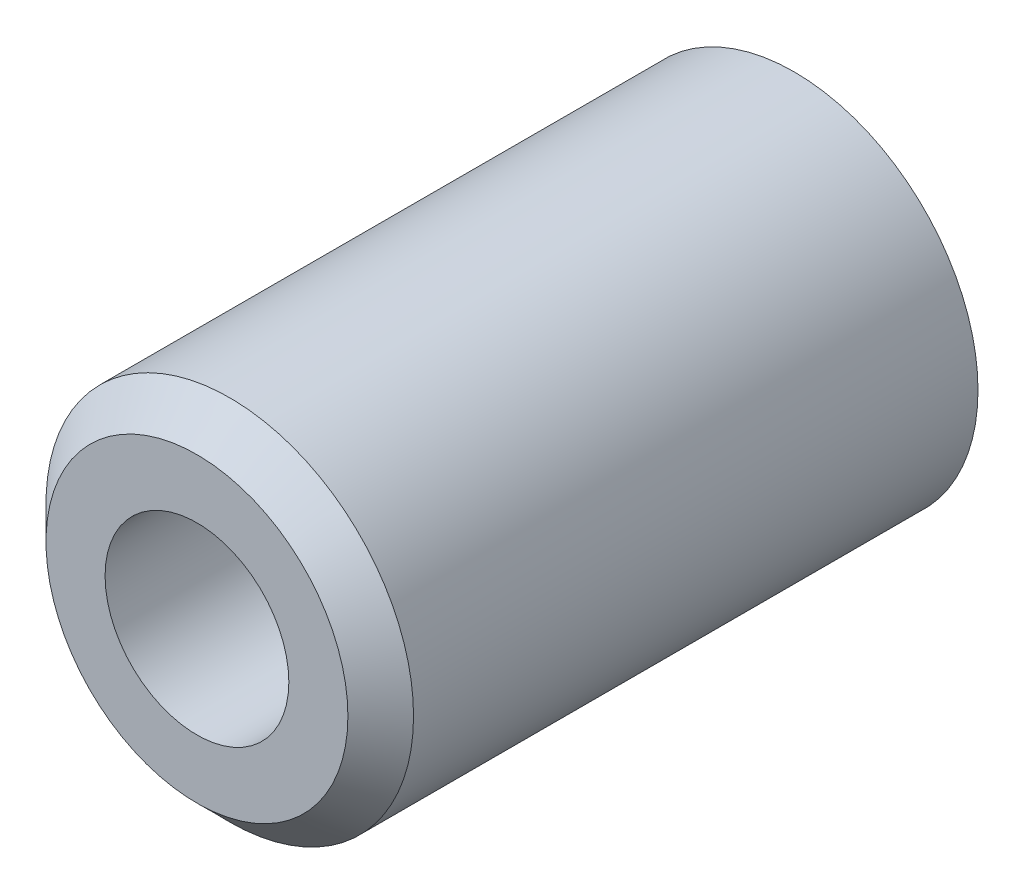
ISO-10303-21;
HEADER;
FILE_DESCRIPTION(('STEP AP214'),'2;1');
FILE_NAME('part.step','',(''),(''),'','','');
FILE_SCHEMA(('AUTOMOTIVE_DESIGN { 1 0 10303 214 1 1 1 1 }'));
ENDSEC;
DATA;
#1=APPLICATION_CONTEXT('core data for automotive mechanical design processes');
#2=APPLICATION_PROTOCOL_DEFINITION('international standard','automotive_design',2000,#1);
#3=PRODUCT_CONTEXT('',#1,'mechanical');
#4=PRODUCT('Part','Part','',(#3));
#5=PRODUCT_RELATED_PRODUCT_CATEGORY('part','',(#4));
#6=PRODUCT_DEFINITION_FORMATION('','',#4);
#7=PRODUCT_DEFINITION_CONTEXT('part definition',#1,'design');
#8=PRODUCT_DEFINITION('design','',#6,#7);
#9=PRODUCT_DEFINITION_SHAPE('','',#8);
#10=(LENGTH_UNIT() NAMED_UNIT(*) SI_UNIT(.MILLI.,.METRE.));
#11=(NAMED_UNIT(*) PLANE_ANGLE_UNIT() SI_UNIT($,.RADIAN.));
#12=(NAMED_UNIT(*) SI_UNIT($,.STERADIAN.) SOLID_ANGLE_UNIT());
#13=UNCERTAINTY_MEASURE_WITH_UNIT(LENGTH_MEASURE(1.E-05),#10,'distance_accuracy_value','');
#14=(GEOMETRIC_REPRESENTATION_CONTEXT(3) GLOBAL_UNCERTAINTY_ASSIGNED_CONTEXT((#13)) GLOBAL_UNIT_ASSIGNED_CONTEXT((#10,
#11,#12)) REPRESENTATION_CONTEXT('',''));
#15=CARTESIAN_POINT('',(0.,0.,0.));
#16=DIRECTION('',(0.,0.,1.));
#17=DIRECTION('',(1.,0.,0.));
#18=AXIS2_PLACEMENT_3D('',#15,#16,#17);
#19=CARTESIAN_POINT('',(0.,0.,64.));
#20=DIRECTION('',(0.,0.,-1.));
#21=DIRECTION('',(1.,0.,0.));
#22=AXIS2_PLACEMENT_3D('',#19,#20,#21);
#23=CYLINDRICAL_SURFACE('',#22,14.0000000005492);
#24=CARTESIAN_POINT('',(0.,0.,64.));
#25=DIRECTION('',(0.,0.,-1.));
#26=DIRECTION('',(-0.707106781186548,0.707106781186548,0.));
#27=AXIS2_PLACEMENT_3D('',#24,#25,#26);
#28=CIRCLE('',#27,14.0000000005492);
#29=CARTESIAN_POINT('',(-9.89949493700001,9.89949493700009,63.9999999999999));
#30=VERTEX_POINT('',#29);
#31=EDGE_CURVE('E33',#30,#30,#28,.T.);
#32=ORIENTED_EDGE('',*,*,#31,.T.);
#33=EDGE_LOOP('',(#32));
#34=FACE_BOUND('',#33,.T.);
#35=CARTESIAN_POINT('',(0.,0.,21.));
#36=DIRECTION('',(0.,0.,1.));
#37=DIRECTION('',(0.,-1.,0.));
#38=AXIS2_PLACEMENT_3D('',#35,#36,#37);
#39=CIRCLE('',#38,14.0000000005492);
#40=CARTESIAN_POINT('',(0.,-14.0000000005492,21.));
#41=VERTEX_POINT('',#40);
#42=EDGE_CURVE('E67',#41,#41,#39,.T.);
#43=ORIENTED_EDGE('',*,*,#42,.T.);
#44=EDGE_LOOP('',(#43));
#45=FACE_BOUND('',#44,.T.);
#46=ADVANCED_FACE('F12',(#34,#45),#23,.T.);
#47=CARTESIAN_POINT('',(0.,0.,66.5));
#48=DIRECTION('',(0.,0.,-1.));
#49=DIRECTION('',(1.,0.,0.));
#50=AXIS2_PLACEMENT_3D('',#47,#48,#49);
#51=CONICAL_SURFACE('',#50,11.5000000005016,0.785398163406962);
#52=ORIENTED_EDGE('',*,*,#31,.F.);
#53=EDGE_LOOP('',(#52));
#54=FACE_BOUND('',#53,.T.);
#55=CARTESIAN_POINT('',(0.,0.,66.5));
#56=DIRECTION('',(0.,0.,-1.));
#57=DIRECTION('',(1.,0.,0.));
#58=AXIS2_PLACEMENT_3D('',#55,#56,#57);
#59=CIRCLE('',#58,11.5000000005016);
#60=CARTESIAN_POINT('',(11.5000000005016,0.,66.5));
#61=VERTEX_POINT('',#60);
#62=EDGE_CURVE('E16',#61,#61,#59,.T.);
#63=ORIENTED_EDGE('',*,*,#62,.T.);
#64=EDGE_LOOP('',(#63));
#65=FACE_BOUND('',#64,.T.);
#66=ADVANCED_FACE('F49',(#54,#65),#51,.T.);
#67=CARTESIAN_POINT('',(0.,-16.4586174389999,66.5));
#68=DIRECTION('',(0.,0.,-1.));
#69=DIRECTION('',(-0.707106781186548,0.707106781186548,0.));
#70=AXIS2_PLACEMENT_3D('',#67,#68,#69);
#71=PLANE('',#70);
#72=CARTESIAN_POINT('',(0.,0.,66.5));
#73=DIRECTION('',(0.,0.,-1.));
#74=DIRECTION('',(1.,0.,0.));
#75=AXIS2_PLACEMENT_3D('',#72,#73,#74);
#76=CIRCLE('',#75,6.99999999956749);
#77=CARTESIAN_POINT('',(6.9999999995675,0.,66.5));
#78=VERTEX_POINT('',#77);
#79=EDGE_CURVE('E62',#78,#78,#76,.F.);
#80=ORIENTED_EDGE('',*,*,#79,.F.);
#81=EDGE_LOOP('',(#80));
#82=FACE_BOUND('',#81,.T.);
#83=ORIENTED_EDGE('',*,*,#62,.F.);
#84=EDGE_LOOP('',(#83));
#85=FACE_BOUND('',#84,.T.);
#86=ADVANCED_FACE('F46',(#82,#85),#71,.F.);
#87=CARTESIAN_POINT('',(-20.036577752,0.,21.));
#88=DIRECTION('',(0.,0.,1.));
#89=DIRECTION('',(0.707106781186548,-0.707106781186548,0.));
#90=AXIS2_PLACEMENT_3D('',#87,#88,#89);
#91=PLANE('',#90);
#92=CARTESIAN_POINT('',(0.,0.,21.));
#93=DIRECTION('',(0.,0.,-1.));
#94=DIRECTION('',(1.,0.,0.));
#95=AXIS2_PLACEMENT_3D('',#92,#93,#94);
#96=CIRCLE('',#95,6.99999999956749);
#97=CARTESIAN_POINT('',(6.99999999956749,0.,21.));
#98=VERTEX_POINT('',#97);
#99=EDGE_CURVE('E25',#98,#98,#96,.T.);
#100=ORIENTED_EDGE('',*,*,#99,.F.);
#101=EDGE_LOOP('',(#100));
#102=FACE_BOUND('',#101,.T.);
#103=ORIENTED_EDGE('',*,*,#42,.F.);
#104=EDGE_LOOP('',(#103));
#105=FACE_BOUND('',#104,.T.);
#106=ADVANCED_FACE('F14',(#102,#105),#91,.F.);
#107=CARTESIAN_POINT('',(0.,0.,66.5));
#108=DIRECTION('',(0.,0.,-1.));
#109=DIRECTION('',(1.,0.,0.));
#110=AXIS2_PLACEMENT_3D('',#107,#108,#109);
#111=CYLINDRICAL_SURFACE('',#110,6.99999999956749);
#112=ORIENTED_EDGE('',*,*,#99,.T.);
#113=EDGE_LOOP('',(#112));
#114=FACE_BOUND('',#113,.T.);
#115=ORIENTED_EDGE('',*,*,#79,.T.);
#116=EDGE_LOOP('',(#115));
#117=FACE_BOUND('',#116,.T.);
#118=CARTESIAN_POINT('',(-6.06217760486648,3.50000038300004,34.5000000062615));
#119=CARTESIAN_POINT('',(-6.06217480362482,3.50000263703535,34.4086998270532));
#120=CARTESIAN_POINT('',(-6.06424565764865,3.49642505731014,34.3174216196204));
#121=CARTESIAN_POINT('',(-6.07244251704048,3.48217079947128,34.1355769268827));
#122=CARTESIAN_POINT('',(-6.07856941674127,3.47149255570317,34.0450106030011));
#123=CARTESIAN_POINT('',(-6.09466065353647,3.44316359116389,33.8652458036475));
#124=CARTESIAN_POINT('',(-6.10462819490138,3.42550704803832,33.7760485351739));
#125=CARTESIAN_POINT('',(-6.12803887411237,3.38344708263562,33.599711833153));
#126=CARTESIAN_POINT('',(-6.14148348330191,3.35904080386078,33.512573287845));
#127=CARTESIAN_POINT('',(-6.18621679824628,3.27637938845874,33.2560375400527));
#128=CARTESIAN_POINT('',(-6.22201272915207,3.20850375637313,33.0904168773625));
#129=CARTESIAN_POINT('',(-6.30148683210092,3.04944788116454,32.7730161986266));
#130=CARTESIAN_POINT('',(-6.34516689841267,2.95826203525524,32.6212395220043));
#131=CARTESIAN_POINT('',(-6.43989086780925,2.74633061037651,32.321934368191));
#132=CARTESIAN_POINT('',(-6.49124497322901,2.62376849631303,32.1757863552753));
#133=CARTESIAN_POINT('',(-6.5930199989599,2.35639316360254,31.9050673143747));
#134=CARTESIAN_POINT('',(-6.64344047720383,2.21156969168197,31.7805062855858));
#135=CARTESIAN_POINT('',(-6.74175639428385,1.89167355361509,31.548201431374));
#136=CARTESIAN_POINT('',(-6.78925236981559,1.71521972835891,31.442157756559));
#137=CARTESIAN_POINT('',(-6.85154149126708,1.4371772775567,31.3070085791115));
#138=CARTESIAN_POINT('',(-6.87081764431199,1.34223112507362,31.2659339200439));
#139=CARTESIAN_POINT('',(-6.90583508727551,1.14851966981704,31.1921878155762));
#140=CARTESIAN_POINT('',(-6.92157836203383,1.04975654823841,31.1595116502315));
#141=CARTESIAN_POINT('',(-6.94806560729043,0.856293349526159,31.1049825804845));
#142=CARTESIAN_POINT('',(-6.9590843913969,0.761799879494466,31.082527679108));
#143=CARTESIAN_POINT('',(-6.97733373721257,0.570960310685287,31.0455176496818));
#144=CARTESIAN_POINT('',(-6.98456615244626,0.474615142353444,31.0309586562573));
#145=CARTESIAN_POINT('',(-6.99503582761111,0.280850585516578,31.0099262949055));
#146=CARTESIAN_POINT('',(-6.99827421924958,0.183431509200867,31.0034506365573));
#147=CARTESIAN_POINT('',(-7.00067156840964,-0.0116269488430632,30.9986572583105));
#148=CARTESIAN_POINT('',(-6.99983077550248,-0.109266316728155,31.0003390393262));
#149=CARTESIAN_POINT('',(-6.99169221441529,-0.384295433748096,31.0166246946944));
#150=CARTESIAN_POINT('',(-6.97964404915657,-0.561093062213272,31.0407359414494));
#151=CARTESIAN_POINT('',(-6.94310174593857,-0.907630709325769,31.1150795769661));
#152=CARTESIAN_POINT('',(-6.91860672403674,-1.07737022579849,31.1653138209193));
#153=CARTESIAN_POINT('',(-6.85900424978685,-1.40807562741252,31.2907901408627));
#154=CARTESIAN_POINT('',(-6.82375455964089,-1.56888749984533,31.3663688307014));
#155=CARTESIAN_POINT('',(-6.74581720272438,-1.87592340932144,31.5399222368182));
#156=CARTESIAN_POINT('',(-6.70312699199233,-2.02214242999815,31.6379046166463));
#157=CARTESIAN_POINT('',(-6.6095577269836,-2.31059469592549,31.8641257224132));
#158=CARTESIAN_POINT('',(-6.55828606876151,-2.45114744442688,31.9943479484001));
#159=CARTESIAN_POINT('',(-6.45591207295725,-2.70934156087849,32.276025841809));
#160=CARTESIAN_POINT('',(-6.40480994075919,-2.82696118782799,32.4275014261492));
#161=CARTESIAN_POINT('',(-6.30501071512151,-3.04334691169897,32.7594117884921));
#162=CARTESIAN_POINT('',(-6.25667714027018,-3.14042354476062,32.9410798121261));
#163=CARTESIAN_POINT('',(-6.19395474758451,-3.26143880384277,33.225766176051));
#164=CARTESIAN_POINT('',(-6.17468308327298,-3.29766705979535,33.3226484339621));
#165=CARTESIAN_POINT('',(-6.14013340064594,-3.36155924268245,33.5198725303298));
#166=CARTESIAN_POINT('',(-6.12485362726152,-3.38922693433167,33.6202128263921));
#167=CARTESIAN_POINT('',(-6.09576150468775,-3.44133789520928,33.8487551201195));
#168=CARTESIAN_POINT('',(-6.08324955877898,-3.46328598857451,33.9777034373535));
#169=CARTESIAN_POINT('',(-6.06646033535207,-3.49261434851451,34.2377831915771));
#170=CARTESIAN_POINT('',(-6.06218162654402,-3.49999714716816,34.3689142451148));
#171=CARTESIAN_POINT('',(-6.06217480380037,-3.50000263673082,34.5913001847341));
#172=CARTESIAN_POINT('',(-6.06424565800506,-3.49642505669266,34.6825783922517));
#173=CARTESIAN_POINT('',(-6.07244251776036,-3.48217079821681,34.8644230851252));
#174=CARTESIAN_POINT('',(-6.07856941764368,-3.47149255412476,34.9549894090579));
#175=CARTESIAN_POINT('',(-6.09466065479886,-3.44316358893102,35.1347542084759));
#176=CARTESIAN_POINT('',(-6.10462819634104,-3.42550704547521,35.2239514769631));
#177=CARTESIAN_POINT('',(-6.1280388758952,-3.3834470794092,35.4002881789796));
#178=CARTESIAN_POINT('',(-6.14148348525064,-3.35904080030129,35.4874267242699));
#179=CARTESIAN_POINT('',(-6.18621680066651,-3.27637938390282,35.7439624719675));
#180=CARTESIAN_POINT('',(-6.2220127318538,-3.20850375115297,35.9095831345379));
#181=CARTESIAN_POINT('',(-6.30148683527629,-3.04944787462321,36.2269838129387));
#182=CARTESIAN_POINT('',(-6.34516690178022,-2.9582620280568,36.3787604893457));
#183=CARTESIAN_POINT('',(-6.43989087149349,-2.74633060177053,36.6780656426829));
#184=CARTESIAN_POINT('',(-6.49124497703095,-2.62376848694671,36.824213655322));
#185=CARTESIAN_POINT('',(-6.5930200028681,-2.35639315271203,37.0949326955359));
#186=CARTESIAN_POINT('',(-6.64344048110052,-2.21156968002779,37.2194937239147));
#187=CARTESIAN_POINT('',(-6.74175639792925,-1.8916735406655,37.4517985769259));
#188=CARTESIAN_POINT('',(-6.7892523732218,-1.71521971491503,37.5578422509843));
#189=CARTESIAN_POINT('',(-6.85154149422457,-1.43717726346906,37.69299142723));
#190=CARTESIAN_POINT('',(-6.87081764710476,-1.34223111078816,37.7340660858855));
#191=CARTESIAN_POINT('',(-6.9058350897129,-1.1485196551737,37.8078121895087));
#192=CARTESIAN_POINT('',(-6.92157836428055,-1.04975653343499,37.8404883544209));
#193=CARTESIAN_POINT('',(-6.94806560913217,-0.856293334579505,37.895017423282));
#194=CARTESIAN_POINT('',(-6.95908439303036,-0.761799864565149,37.9174723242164));
#195=CARTESIAN_POINT('',(-6.97733373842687,-0.570960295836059,37.954482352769));
#196=CARTESIAN_POINT('',(-6.98456615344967,-0.474615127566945,37.969041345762));
#197=CARTESIAN_POINT('',(-6.99503582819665,-0.280850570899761,37.9900737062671));
#198=CARTESIAN_POINT('',(-6.99827421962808,-0.18343149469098,37.9965493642));
#199=CARTESIAN_POINT('',(-7.00067156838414,0.0116269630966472,38.0013427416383));
#200=CARTESIAN_POINT('',(-6.99983077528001,0.109266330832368,37.9996609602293));
#201=CARTESIAN_POINT('',(-6.99169221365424,0.384295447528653,37.9833753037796));
#202=CARTESIAN_POINT('',(-6.97964404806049,0.561093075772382,37.9592640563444));
#203=CARTESIAN_POINT('',(-6.94310174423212,0.907630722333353,37.8849204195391));
#204=CARTESIAN_POINT('',(-6.91860672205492,1.07737023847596,37.8346861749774));
#205=CARTESIAN_POINT('',(-6.85900424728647,1.40807563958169,37.7092098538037));
#206=CARTESIAN_POINT('',(-6.8237545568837,1.56888751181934,37.6336311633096));
#207=CARTESIAN_POINT('',(-6.74581719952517,1.87592342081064,37.460077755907));
#208=CARTESIAN_POINT('',(-6.70312698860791,2.02214244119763,37.3620953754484));
#209=CARTESIAN_POINT('',(-6.60955772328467,2.31059470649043,37.1358742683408));
#210=CARTESIAN_POINT('',(-6.55828606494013,2.45114745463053,37.0056520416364));
#211=CARTESIAN_POINT('',(-6.45591206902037,2.70934157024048,36.7239741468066));
#212=CARTESIAN_POINT('',(-6.40480993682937,2.8269611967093,36.5724985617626));
#213=CARTESIAN_POINT('',(-6.3050107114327,3.0433469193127,36.2405881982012));
#214=CARTESIAN_POINT('',(-6.25667713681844,3.14042355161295,36.0589201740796));
#215=CARTESIAN_POINT('',(-6.19395474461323,3.26143880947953,35.7742338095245));
#216=CARTESIAN_POINT('',(-6.17468308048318,3.29766706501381,35.6773515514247));
#217=CARTESIAN_POINT('',(-6.14013339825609,3.36155924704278,35.4801274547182));
#218=CARTESIAN_POINT('',(-6.12485362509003,3.38922693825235,35.3797871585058));
#219=CARTESIAN_POINT('',(-6.0957615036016,3.44133789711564,35.1512448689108));
#220=CARTESIAN_POINT('',(-6.08324955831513,3.46328598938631,35.022296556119));
#221=CARTESIAN_POINT('',(-6.06646033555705,3.49261434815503,34.7622168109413));
#222=CARTESIAN_POINT('',(-6.06218162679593,3.49999714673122,34.6310857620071));
#223=CARTESIAN_POINT('',(-6.06217760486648,3.50000038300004,34.5000000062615));
#224=B_SPLINE_CURVE_WITH_KNOTS('',3,(#118,#119,#120,#121,#122,#123,#124,#125,#126,#127,#128,
#129,#130,#131,#132,#133,#134,#135,#136,#137,#138,#139,#140,#141,#142,#143,#144,#145,#146,#147,
#148,#149,#150,#151,#152,#153,#154,#155,#156,#157,#158,#159,#160,#161,#162,#163,#164,#165,#166,
#167,#168,#169,#170,#171,#172,#173,#174,#175,#176,#177,#178,#179,#180,#181,#182,#183,#184,#185,
#186,#187,#188,#189,#190,#191,#192,#193,#194,#195,#196,#197,#198,#199,#200,#201,#202,#203,#204,
#205,#206,#207,#208,#209,#210,#211,#212,#213,#214,#215,#216,#217,#218,#219,#220,#221,#222,#223),
.UNSPECIFIED.,.T.,.F.,(4,2,2,2,2,2,2,2,2,2,2,2,2,2,2,2,2,2,2,2,2,2,2,2,2,2,2,2,2,2,2,2,2,2,2,2,
2,2,2,2,2,2,2,2,2,2,2,2,2,2,2,2,4),(0.,0.273769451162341,0.547599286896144,0.821658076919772,
1.09583302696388,1.64085722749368,2.18601255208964,2.77608654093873,3.36643312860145,
3.9965834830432,4.31189690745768,4.62703273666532,4.91988216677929,5.21258810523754,
5.50521108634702,5.79781616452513,6.33156981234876,6.86536137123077,7.40654348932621,
7.94791100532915,8.54040467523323,9.13345733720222,9.76448404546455,10.0797285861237,
10.3948342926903,10.787971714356,11.1810407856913,11.4548102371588,11.728640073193,
12.0026988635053,12.2768738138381,12.8218980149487,13.3670533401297,13.9571273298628,
14.5474739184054,15.1776242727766,15.4929376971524,15.808073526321,16.1009229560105,
16.3936288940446,16.6862518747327,16.9788569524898,17.5126106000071,18.046402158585,
18.5875842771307,19.1289517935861,19.7214454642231,20.3144981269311,20.9455248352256,
21.2607693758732,21.5758750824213,21.969012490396,22.3620815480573),.UNSPECIFIED.);
#225=CARTESIAN_POINT('',(-6.06217760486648,3.50000038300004,34.5000000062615));
#226=VERTEX_POINT('',#225);
#227=EDGE_CURVE('E8',#226,#226,#224,.T.);
#228=ORIENTED_EDGE('',*,*,#227,.T.);
#229=EDGE_LOOP('',(#228));
#230=FACE_BOUND('',#229,.T.);
#231=CARTESIAN_POINT('',(6.06217760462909,-3.50000038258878,34.5000000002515));
#232=CARTESIAN_POINT('',(6.06217480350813,-3.50000263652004,34.4086998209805));
#233=CARTESIAN_POINT('',(6.06424565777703,-3.49642505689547,34.3174216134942));
#234=CARTESIAN_POINT('',(6.0724425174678,-3.48217079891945,34.1355769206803));
#235=CARTESIAN_POINT('',(6.07856941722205,-3.47149255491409,34.0450105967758));
#236=CARTESIAN_POINT('',(6.09466065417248,-3.4431635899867,33.8652457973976));
#237=CARTESIAN_POINT('',(6.10462819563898,-3.42550704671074,33.7760485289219));
#238=CARTESIAN_POINT('',(6.128038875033,-3.38344708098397,33.5997118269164));
#239=CARTESIAN_POINT('',(6.14148348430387,-3.35904080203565,33.5125732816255));
#240=CARTESIAN_POINT('',(6.18621679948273,-3.27637938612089,33.2560375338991));
#241=CARTESIAN_POINT('',(6.2220127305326,-3.20850375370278,33.0904168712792));
#242=CARTESIAN_POINT('',(6.30148683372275,-3.04944787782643,32.7730161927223));
#243=CARTESIAN_POINT('',(6.34516690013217,-2.95826203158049,32.6212395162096));
#244=CARTESIAN_POINT('',(6.43989086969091,-2.74633060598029,32.3219343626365));
#245=CARTESIAN_POINT('',(6.49124497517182,-2.62376849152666,32.1757863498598));
#246=CARTESIAN_POINT('',(6.59302000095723,-2.35639315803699,31.9050673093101));
#247=CARTESIAN_POINT('',(6.64344047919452,-2.21156968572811,31.7805062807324));
#248=CARTESIAN_POINT('',(6.74175639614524,-1.89167354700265,31.5482014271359));
#249=CARTESIAN_POINT('',(6.78925237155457,-1.71521972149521,31.4421577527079));
#250=CARTESIAN_POINT('',(6.8515414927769,-1.43717727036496,31.3070085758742));
#251=CARTESIAN_POINT('',(6.87081764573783,-1.34223111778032,31.2659339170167));
#252=CARTESIAN_POINT('',(6.9058350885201,-1.14851966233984,31.1921878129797));
#253=CARTESIAN_POINT('',(6.92157836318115,-1.04975654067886,31.1595116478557));
#254=CARTESIAN_POINT('',(6.94806560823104,-0.856293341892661,31.1049825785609));
#255=CARTESIAN_POINT('',(6.95908439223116,-0.761799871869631,31.0825276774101));
#256=CARTESIAN_POINT('',(6.97733373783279,-0.570960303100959,31.04551764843));
#257=CARTESIAN_POINT('',(6.98456615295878,-0.474615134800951,31.0309586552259));
#258=CARTESIAN_POINT('',(6.99503582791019,-0.280850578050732,31.0099262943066));
#259=CARTESIAN_POINT('',(6.99827421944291,-0.183431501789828,31.0034506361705));
#260=CARTESIAN_POINT('',(7.00067156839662,0.0116269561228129,30.9986572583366));
#261=CARTESIAN_POINT('',(6.99983077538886,0.109266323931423,31.0003390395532));
#262=CARTESIAN_POINT('',(6.99169221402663,0.384295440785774,31.0166246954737));
#263=CARTESIAN_POINT('',(6.97964404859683,0.561093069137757,31.0407359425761));
#264=CARTESIAN_POINT('',(6.94310174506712,0.907630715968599,31.1150795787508));
#265=CARTESIAN_POINT('',(6.91860672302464,1.07737023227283,31.1653138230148));
#266=CARTESIAN_POINT('',(6.8590042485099,1.40807563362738,31.2907901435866));
#267=CARTESIAN_POINT('',(6.82375455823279,1.56888750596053,31.36636883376));
#268=CARTESIAN_POINT('',(6.74581720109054,1.87592341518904,31.5399222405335));
#269=CARTESIAN_POINT('',(6.7031269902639,2.02214243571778,31.6379046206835));
#270=CARTESIAN_POINT('',(6.60955772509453,2.31059470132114,31.8641257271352));
#271=CARTESIAN_POINT('',(6.55828606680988,2.45114744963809,31.9943479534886));
#272=CARTESIAN_POINT('',(6.45591207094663,2.70934156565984,32.2760258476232));
#273=CARTESIAN_POINT('',(6.40480993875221,2.82696119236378,32.4275014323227));
#274=CARTESIAN_POINT('',(6.3050107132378,3.04334691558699,32.7594117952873));
#275=CARTESIAN_POINT('',(6.25667713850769,3.14042354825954,32.9410798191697));
#276=CARTESIAN_POINT('',(6.19395474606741,3.26143880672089,33.225766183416));
#277=CARTESIAN_POINT('',(6.1746830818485,3.29766706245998,33.3226484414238));
#278=CARTESIAN_POINT('',(6.14013339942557,3.36155924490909,33.519872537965));
#279=CARTESIAN_POINT('',(6.12485362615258,3.3892269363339,33.6202128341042));
#280=CARTESIAN_POINT('',(6.09576150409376,3.44133789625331,33.8487551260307));
#281=CARTESIAN_POINT('',(6.08324955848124,3.46328598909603,33.9777034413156));
#282=CARTESIAN_POINT('',(6.06646033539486,3.4926143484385,34.2377831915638));
#283=CARTESIAN_POINT('',(6.06218162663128,3.4999971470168,34.3689142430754));
#284=CARTESIAN_POINT('',(6.06217480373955,3.50000263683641,34.5913001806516));
#285=CARTESIAN_POINT('',(6.0642456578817,3.49642505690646,34.6825783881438));
#286=CARTESIAN_POINT('',(6.07244251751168,3.48217079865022,34.8644230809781));
#287=CARTESIAN_POINT('',(6.07856941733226,3.47149255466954,34.954989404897));
#288=CARTESIAN_POINT('',(6.09466065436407,3.44316358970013,35.1347542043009));
#289=CARTESIAN_POINT('',(6.10462819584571,3.42550704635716,35.2239514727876));
#290=CARTESIAN_POINT('',(6.128038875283,3.38344708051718,35.4002881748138));
#291=CARTESIAN_POINT('',(6.14148348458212,3.35904080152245,35.4874267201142));
#292=CARTESIAN_POINT('',(6.18621679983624,3.27637938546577,35.7439624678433));
#293=CARTESIAN_POINT('',(6.22201273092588,3.20850375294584,35.9095831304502));
#294=CARTESIAN_POINT('',(6.30148683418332,3.04944787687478,36.2269838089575));
#295=CARTESIAN_POINT('',(6.34516690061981,2.95826203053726,36.3787604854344));
#296=CARTESIAN_POINT('',(6.43989087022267,2.74633060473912,36.6780656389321));
#297=CARTESIAN_POINT('',(6.49124497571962,2.62376849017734,36.8242136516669));
#298=CARTESIAN_POINT('',(6.5930200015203,2.3563931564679,37.094932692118));
#299=CARTESIAN_POINT('',(6.64344047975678,2.21156968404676,37.2194937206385));
#300=CARTESIAN_POINT('',(6.74175639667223,1.89167354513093,37.4517985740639));
#301=CARTESIAN_POINT('',(6.78925237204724,1.71521971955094,37.5578422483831));
#302=CARTESIAN_POINT('',(6.85154149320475,1.43717726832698,37.6929914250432));
#303=CARTESIAN_POINT('',(6.87081764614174,1.34223111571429,37.7340660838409));
#304=CARTESIAN_POINT('',(6.90583508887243,1.1485196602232,37.8078121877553));
#305=CARTESIAN_POINT('',(6.92157836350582,1.04975653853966,37.8404883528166));
#306=CARTESIAN_POINT('',(6.9480656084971,0.856293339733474,37.8950174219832));
#307=CARTESIAN_POINT('',(6.95908439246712,0.761799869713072,37.9174723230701));
#308=CARTESIAN_POINT('',(6.97733373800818,0.57096030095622,37.954482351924));
#309=CARTESIAN_POINT('',(6.98456615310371,0.474615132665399,37.9690413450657));
#310=CARTESIAN_POINT('',(6.99503582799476,0.280850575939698,37.9900737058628));
#311=CARTESIAN_POINT('',(6.99827421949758,0.183431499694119,37.9965493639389));
#312=CARTESIAN_POINT('',(7.00067156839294,-0.0116269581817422,38.001342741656));
#313=CARTESIAN_POINT('',(6.99983077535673,-0.109266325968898,37.9996609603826));
#314=CARTESIAN_POINT('',(6.99169221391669,-0.384295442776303,37.9833753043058));
#315=CARTESIAN_POINT('',(6.97964404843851,-0.561093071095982,37.9592640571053));
#316=CARTESIAN_POINT('',(6.94310174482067,-0.907630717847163,37.8849204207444));
#317=CARTESIAN_POINT('',(6.91860672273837,-1.07737023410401,37.8346861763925));
#318=CARTESIAN_POINT('',(6.85900424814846,-1.40807563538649,37.7092098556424));
#319=CARTESIAN_POINT('',(6.82375455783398,-1.56888750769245,37.6336311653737));
#320=CARTESIAN_POINT('',(6.7458172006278,-1.87592341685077,37.4600777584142));
#321=CARTESIAN_POINT('',(6.70312698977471,-2.02214243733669,37.3620953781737));
#322=CARTESIAN_POINT('',(6.60955772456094,-2.31059470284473,37.135874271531));
#323=CARTESIAN_POINT('',(6.55828606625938,-2.45114745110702,37.0056520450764));
#324=CARTESIAN_POINT('',(6.45591207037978,-2.70934156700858,36.7239741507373));
#325=CARTESIAN_POINT('',(6.40480993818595,-2.82696119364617,36.5724985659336));
#326=CARTESIAN_POINT('',(6.30501071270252,-3.04334691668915,36.2405882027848));
#327=CARTESIAN_POINT('',(6.2566771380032,-3.14042354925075,36.0589201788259));
#328=CARTESIAN_POINT('',(6.19395474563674,-3.26143880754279,35.7742338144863));
#329=CARTESIAN_POINT('',(6.17468308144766,-3.2976670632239,35.6773515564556));
#330=CARTESIAN_POINT('',(6.14013339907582,-3.36155924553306,35.4801274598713));
#331=CARTESIAN_POINT('',(6.1248536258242,-3.38922693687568,35.3797871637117));
#332=CARTESIAN_POINT('',(6.09576150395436,-3.44133789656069,35.1512448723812));
#333=CARTESIAN_POINT('',(6.08324955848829,-3.46328598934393,35.0222965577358));
#334=CARTESIAN_POINT('',(6.06646033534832,-3.49261434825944,34.7622168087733));
#335=CARTESIAN_POINT('',(6.0621816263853,-3.49999714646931,34.6310857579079));
#336=CARTESIAN_POINT('',(6.06217760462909,-3.50000038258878,34.5000000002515));
#337=B_SPLINE_CURVE_WITH_KNOTS('',3,(#231,#232,#233,#234,#235,#236,#237,#238,#239,#240,#241,
#242,#243,#244,#245,#246,#247,#248,#249,#250,#251,#252,#253,#254,#255,#256,#257,#258,#259,#260,
#261,#262,#263,#264,#265,#266,#267,#268,#269,#270,#271,#272,#273,#274,#275,#276,#277,#278,#279,
#280,#281,#282,#283,#284,#285,#286,#287,#288,#289,#290,#291,#292,#293,#294,#295,#296,#297,#298,
#299,#300,#301,#302,#303,#304,#305,#306,#307,#308,#309,#310,#311,#312,#313,#314,#315,#316,#317,
#318,#319,#320,#321,#322,#323,#324,#325,#326,#327,#328,#329,#330,#331,#332,#333,#334,#335,#336),
.UNSPECIFIED.,.T.,.F.,(4,2,2,2,2,2,2,2,2,2,2,2,2,2,2,2,2,2,2,2,2,2,2,2,2,2,2,2,2,2,2,2,2,2,2,2,
2,2,2,2,2,2,2,2,2,2,2,2,2,2,2,2,4),(0.,0.273769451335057,0.547599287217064,0.821658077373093,
1.09583302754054,1.6408572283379,2.18601255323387,2.77608654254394,3.36643313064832,
3.99658348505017,4.31189690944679,4.62703273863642,4.91988216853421,5.21258810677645,
5.50521108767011,5.79781616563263,6.33156981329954,6.86536137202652,7.40654349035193,
7.94791100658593,8.5404046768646,9.13345733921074,9.76448404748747,10.0797285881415,
10.3948342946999,10.7879717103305,11.1810407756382,11.4548102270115,11.7286400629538,
12.0026988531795,12.2768738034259,12.821898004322,13.3670533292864,13.9571273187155,
14.5474739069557,15.1776242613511,15.4929376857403,15.8080735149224,16.1009229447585,
16.3936288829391,16.6862518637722,16.9788569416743,17.512610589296,18.04640214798,
18.587584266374,19.1289517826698,19.7214454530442,20.3144981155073,20.9455248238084,
21.2607693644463,21.5758750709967,21.9690124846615,22.3620815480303),.UNSPECIFIED.);
#338=CARTESIAN_POINT('',(6.06217760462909,-3.50000038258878,34.5000000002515));
#339=VERTEX_POINT('',#338);
#340=EDGE_CURVE('E20',#339,#339,#337,.T.);
#341=ORIENTED_EDGE('',*,*,#340,.T.);
#342=EDGE_LOOP('',(#341));
#343=FACE_BOUND('',#342,.T.);
#344=ADVANCED_FACE('F39',(#114,#117,#230,#343),#111,.F.);
#345=CARTESIAN_POINT('',(-7.08405705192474,0.,34.5));
#346=DIRECTION('',(1.,0.,0.));
#347=DIRECTION('',(0.,0.,1.));
#348=AXIS2_PLACEMENT_3D('',#345,#346,#347);
#349=CYLINDRICAL_SURFACE('',#348,3.500000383);
#350=ORIENTED_EDGE('',*,*,#340,.F.);
#351=EDGE_LOOP('',(#350));
#352=FACE_BOUND('',#351,.T.);
#353=ORIENTED_EDGE('',*,*,#227,.F.);
#354=EDGE_LOOP('',(#353));
#355=FACE_BOUND('',#354,.T.);
#356=ADVANCED_FACE('F42',(#352,#355),#349,.T.);
#357=CLOSED_SHELL('',(#46,#66,#86,#106,#344,#356));
#358=MANIFOLD_SOLID_BREP('B1',#357);
#359=ADVANCED_BREP_SHAPE_REPRESENTATION('',(#18,#358),#14);
#360=SHAPE_DEFINITION_REPRESENTATION(#9,#359);
ENDSEC;
END-ISO-10303-21;
